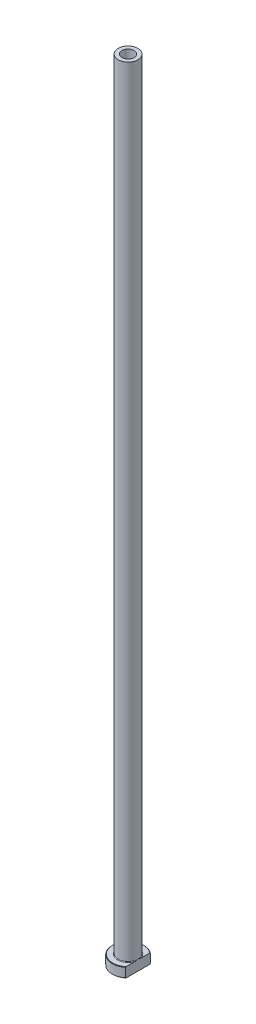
from build123d import *

# Parameters (mm, degrees)
FILLET1_R          = 0.3
CHAMFER1_SIZE      = 0.2
CUT_EXTRUDE1_DEPTH = 401.159968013
CHAMFER2_SIZE      = 0.5


with BuildPart() as part:
    # Sketch1 → Revolve1 (revolve)
    with BuildSketch(Plane.XY, mode=Mode.PRIVATE) as revolve1_sk:
        Polygon((-3.1, 400), (-5, 400), (-5, 5), (-8, 5), (-8, 0), (-3.35, 0), (-3.35, 343), (-3.1, 355), align=None)
    revolve(revolve1_sk.sketch.rotate(Axis((0, 92.187680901, 0), (0, -1, 0)), 270), axis=Axis((0, 92.187680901, 0), (0, -1, 0)))

    # Fillet1
    fillet1_edges = [part.edges().sort_by_distance(p)[0] for p in [
        (0, 5, -5),
    ]]
    fillet(fillet1_edges, radius=FILLET1_R)

    # Chamfer1
    chamfer1_edges = [part.edges().sort_by_distance(p)[0] for p in [
        (0, 0, -8),
        (0, 5, -8),
    ]]
    chamfer(chamfer1_edges, length=CHAMFER1_SIZE)

    # Sketch2 → Cut-Extrude1 (cut, through all)
    with BuildSketch(Plane.XZ):
        with BuildLine():
            Line((5, 6.244997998), (5, -6.244997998))
            ThreePointArc((5, -6.244997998), (8, 0), (5, 6.244997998))
        make_face()
    extrude(amount=-CUT_EXTRUDE1_DEPTH, mode=Mode.SUBTRACT)

    # Chamfer2
    chamfer2_edges = [part.edges().sort_by_distance(p)[0] for p in [
        (0, 0, -3.35),
    ]]
    chamfer(chamfer2_edges, length=CHAMFER2_SIZE)


solid = part.part
